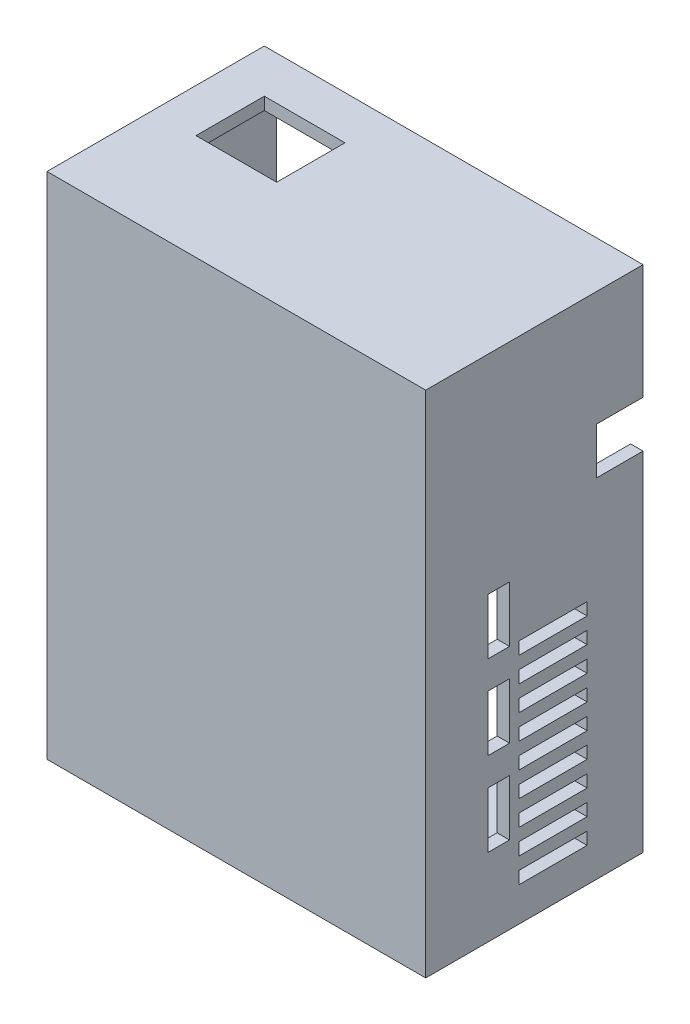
from build123d import *

# Parameters (mm, degrees)
CROQUIS1_W              = 61
CROQUIS1_H              = 82
SALIENTE_EXTRUIR1_DEPTH = 35
CROQUIS2_W              = 57
CROQUIS2_H              = 78
CORTAR_EXTRUIR1_DEPTH   = 33
CROQUIS3_W              = 4
CROQUIS3_H              = 4
SALIENTE_EXTRUIR2_DEPTH = 10
CROQUIS4_R              = 1.5
CORTAR_EXTRUIR2_DEPTH   = 1.5
CROQUIS5_W              = 4
CROQUIS5_H              = 4
CROQUIS5_R              = 0.6
CROQUIS5_W_2            = 5
CROQUIS5_H_2            = 5
CROQUIS5_R_2            = 1
SALIENTE_EXTRUIR3_DEPTH = 4
CROQUIS7_R              = 1
CORTAR_EXTRUIR3_DEPTH   = 6
CROQUIS10_R             = 1
CORTAR_EXTRUIR4_DEPTH   = 6
CROQUIS11_W             = 7
CROQUIS11_H             = 7
CORTAR_EXTRUIR8_DEPTH   = 6
CROQUIS16_W             = 7.497399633
CROQUIS16_H             = 7.5
CORTAR_EXTRUIR9_DEPTH   = 6
CROQUIS17_W             = 11
CROQUIS17_H             = 2
CORTAR_EXTRUIR10_DEPTH  = 70
CROQUIS18_W             = 8
CROQUIS18_H             = 8
CROQUIS18_W_2           = 10
CROQUIS18_W_3           = 5
CROQUIS18_H_2           = 5
CORTAR_EXTRUIR11_DEPTH  = 7
CROQUIS20_W             = 13
CROQUIS20_H             = 11
CORTAR_EXTRUIR12_DEPTH  = 10
CROQUIS21_W             = 3.5
CROQUIS21_H             = 9
CORTAR_EXTRUIR13_DEPTH  = 2


with BuildPart() as part:
    # Croquis1 → Saliente-Extruir1 (new body)
    with BuildSketch(Plane.XY):
        with Locations((-34.346097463, 15.634732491)):
            Rectangle(CROQUIS1_W, CROQUIS1_H)
    extrude(amount=SALIENTE_EXTRUIR1_DEPTH)

    # Croquis2 → Cortar-Extruir1 (cut)
    with BuildSketch(Plane(origin=(0, 0, 0), x_dir=(-1, 0, 0), z_dir=(0, 0, -1))):
        with Locations((34.346097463, 15.634732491)):
            Rectangle(CROQUIS2_W, CROQUIS2_H)
    extrude(amount=-CORTAR_EXTRUIR1_DEPTH, mode=Mode.SUBTRACT)

    # Croquis3 → Saliente-Extruir2 (add)
    with BuildSketch(Plane(origin=(0, 0, 0), x_dir=(-1, 0, 0), z_dir=(0, 0, -1))):
        with Locations((62.846097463, 54.634732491)):
            Rectangle(CROQUIS3_W, CROQUIS3_H)
        with Locations((5.846097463, 54.634732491)):
            Rectangle(CROQUIS3_W, CROQUIS3_H)
        with Locations((5.846097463, -23.365267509)):
            Rectangle(CROQUIS3_W, CROQUIS3_H)
        with Locations((62.846097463, -23.365267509)):
            Rectangle(CROQUIS3_W, CROQUIS3_H)
    extrude(amount=-SALIENTE_EXTRUIR2_DEPTH)

    # Croquis4 → Cortar-Extruir2 (cut)
    with BuildSketch(Plane(origin=(0, 0, 33), x_dir=(-1, 0, 0), z_dir=(0, 0, -1))):
        with Locations((56.846097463, -2.365267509)):
            Circle(CROQUIS4_R)
        with Locations((11.846097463, -2.865267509)):
            Circle(CROQUIS4_R)
        with Locations((56.846097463, 42.134732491)):
            Circle(CROQUIS4_R)
        with Locations((11.846097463, 42.134732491)):
            Circle(CROQUIS4_R)
    extrude(amount=-CORTAR_EXTRUIR2_DEPTH, mode=Mode.SUBTRACT)

    # Croquis5 → Saliente-Extruir3 (add)
    # profile 1 of 8: a face of its own
    with BuildSketch(Plane(origin=(0, 0, 33), x_dir=(-1, 0, 0), z_dir=(0, 0, -1))):
        with Locations((13.846097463, 34.134732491)):
            Rectangle(CROQUIS5_W, CROQUIS5_H)
        with Locations((14.346097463, 34.634732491)):
            Circle(CROQUIS5_R, mode=Mode.SUBTRACT)
    # profile 2 of 8: a face of its own
    with BuildSketch(Plane(origin=(0, 0, 33), x_dir=(-1, 0, 0), z_dir=(0, 0, -1))):
        with Locations((56.846097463, -17.365267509)):
            Rectangle(CROQUIS5_W_2, CROQUIS5_H_2)
        with Locations((56.846097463, -17.365267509)):
            Circle(CROQUIS5_R_2, mode=Mode.SUBTRACT)
    # profile 3 of 8: a face of its own
    with BuildSketch(Plane(origin=(0, 0, 33), x_dir=(-1, 0, 0), z_dir=(0, 0, -1))):
        with Locations((11.846097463, -17.365267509)):
            Rectangle(CROQUIS5_W_2, CROQUIS5_H_2)
        with Locations((11.846097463, -17.365267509)):
            Circle(CROQUIS5_R_2, mode=Mode.SUBTRACT)
    # profile 4 of 8: a face of its own
    with BuildSketch(Plane(origin=(0, 0, 33), x_dir=(-1, 0, 0), z_dir=(0, 0, -1))):
        with Locations((11.846097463, 27.634732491)):
            Rectangle(CROQUIS5_W_2, CROQUIS5_H_2)
        with Locations((11.846097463, 27.634732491)):
            Circle(CROQUIS5_R_2, mode=Mode.SUBTRACT)
    # profile 5 of 8: a face of its own
    with BuildSketch(Plane(origin=(0, 0, 33), x_dir=(-1, 0, 0), z_dir=(0, 0, -1))):
        with Locations((56.846097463, 27.634732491)):
            Rectangle(CROQUIS5_W_2, CROQUIS5_H_2)
        with Locations((56.846097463, 27.634732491)):
            Circle(CROQUIS5_R_2, mode=Mode.SUBTRACT)
    # profile 6 of 8: a face of its own
    with BuildSketch(Plane(origin=(0, 0, 33), x_dir=(-1, 0, 0), z_dir=(0, 0, -1))):
        with Locations((13.846097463, 50.134732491)):
            Rectangle(CROQUIS5_W, CROQUIS5_H)
        with Locations((14.346097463, 49.634732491)):
            Circle(CROQUIS5_R, mode=Mode.SUBTRACT)
    # profile 7 of 8: a face of its own
    with BuildSketch(Plane(origin=(0, 0, 33), x_dir=(-1, 0, 0), z_dir=(0, 0, -1))):
        with Locations((54.846097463, 50.134732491)):
            Rectangle(CROQUIS5_W, CROQUIS5_H)
        with Locations((54.346097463, 49.634732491)):
            Circle(CROQUIS5_R, mode=Mode.SUBTRACT)
    # profile 8 of 8: a face of its own
    with BuildSketch(Plane(origin=(0, 0, 33), x_dir=(-1, 0, 0), z_dir=(0, 0, -1))):
        with Locations((54.846097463, 34.134732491)):
            Rectangle(CROQUIS5_W, CROQUIS5_H)
        with Locations((54.346097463, 34.634732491)):
            Circle(CROQUIS5_R, mode=Mode.SUBTRACT)
    extrude(amount=SALIENTE_EXTRUIR3_DEPTH)

    # Croquis7 → Cortar-Extruir3 (cut)
    with BuildSketch(Plane(origin=(0, 0, 0), x_dir=(-1, 0, 0), z_dir=(0, 0, -1))):
        with Locations((5.846097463, -23.365267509)):
            Circle(CROQUIS7_R)
    extrude(amount=-CORTAR_EXTRUIR3_DEPTH, mode=Mode.SUBTRACT)

    # Croquis10 → Cortar-Extruir4 (cut)
    with BuildSketch(Plane(origin=(0, 0, 0), x_dir=(-1, 0, 0), z_dir=(0, 0, -1))):
        with Locations((62.846097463, -23.365267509)):
            Circle(CROQUIS10_R)
        with Locations((5.846097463, 54.634732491)):
            Circle(CROQUIS10_R)
        with Locations((62.846097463, 54.634732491)):
            Circle(CROQUIS10_R)
    extrude(amount=-CORTAR_EXTRUIR4_DEPTH, mode=Mode.SUBTRACT)

    # Croquis11 → Cortar-Extruir8 (cut)
    with BuildSketch(Plane.ZY.offset(64.846097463)):
        with Locations((3.5, 5.134732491)):
            Rectangle(CROQUIS11_W, CROQUIS11_H)
    extrude(amount=-CORTAR_EXTRUIR8_DEPTH, mode=Mode.SUBTRACT)

    # Croquis16 → Cortar-Extruir9 (cut)
    with BuildSketch(Plane(origin=(-3.846097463, 0, 0), x_dir=(0, 0, -1), z_dir=(1, 0, 0))):
        with Locations((-3.748699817, 34.384732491)):
            Rectangle(CROQUIS16_W, CROQUIS16_H)
    extrude(amount=-CORTAR_EXTRUIR9_DEPTH, mode=Mode.SUBTRACT)

    # Croquis17 → Cortar-Extruir10 (cut)
    with BuildSketch(Plane.ZY.offset(64.846097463)):
        with Locations((14.5, -14.865267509)):
            Rectangle(CROQUIS17_W, CROQUIS17_H)
        with Locations((14.5, -18.865267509)):
            Rectangle(CROQUIS17_W, CROQUIS17_H)
        with Locations((14.5, -10.865267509)):
            Rectangle(CROQUIS17_W, CROQUIS17_H)
        with Locations((14.5, -6.865267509)):
            Rectangle(CROQUIS17_W, CROQUIS17_H)
        with Locations((14.5, -2.865267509)):
            Rectangle(CROQUIS17_W, CROQUIS17_H)
        with Locations((14.5, 1.134732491)):
            Rectangle(CROQUIS17_W, CROQUIS17_H)
        with Locations((14.5, 5.134732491)):
            Rectangle(CROQUIS17_W, CROQUIS17_H)
        with Locations((14.5, 9.134732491)):
            Rectangle(CROQUIS17_W, CROQUIS17_H)
        with Locations((14.5, 13.134732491)):
            Rectangle(CROQUIS17_W, CROQUIS17_H)
    extrude(amount=-CORTAR_EXTRUIR10_DEPTH, mode=Mode.SUBTRACT)

    # Croquis18 → Cortar-Extruir11 (cut)
    with BuildSketch(Plane.XZ.offset(25.365267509)):
        with Locations((-34.346097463, 17)):
            Rectangle(CROQUIS18_W, CROQUIS18_H)
        with Locations((-46.346097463, 25)):
            Rectangle(CROQUIS18_W_2, CROQUIS18_H)
        with Locations((-13.346097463, 9.5)):
            Rectangle(CROQUIS18_W_3, CROQUIS18_H_2)
    extrude(amount=-CORTAR_EXTRUIR11_DEPTH, mode=Mode.SUBTRACT)

    # Croquis20 → Cortar-Extruir12 (cut)
    with BuildSketch(Plane(origin=(0, 56.634732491, 0), x_dir=(-1, 0, 0), z_dir=(0, 1, 0))):
        with Locations((51.346097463, 12.5)):
            Rectangle(CROQUIS20_W, CROQUIS20_H)
    extrude(amount=-CORTAR_EXTRUIR12_DEPTH, mode=Mode.SUBTRACT)

    # Croquis21 → Cortar-Extruir13 (cut)
    with BuildSketch(Plane(origin=(-3.846097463, 0, 0), x_dir=(0, 0, -1), z_dir=(1, 0, 0))):
        with Locations((-23.25, -8.365267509)):
            Rectangle(CROQUIS21_W, CROQUIS21_H)
        with Locations((-23.25, 5.134732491)):
            Rectangle(CROQUIS21_W, CROQUIS21_H)
        with Locations((-23.25, 18.634732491)):
            Rectangle(CROQUIS21_W, CROQUIS21_H)
    extrude(amount=-CORTAR_EXTRUIR13_DEPTH, mode=Mode.SUBTRACT)


solid = part.part
